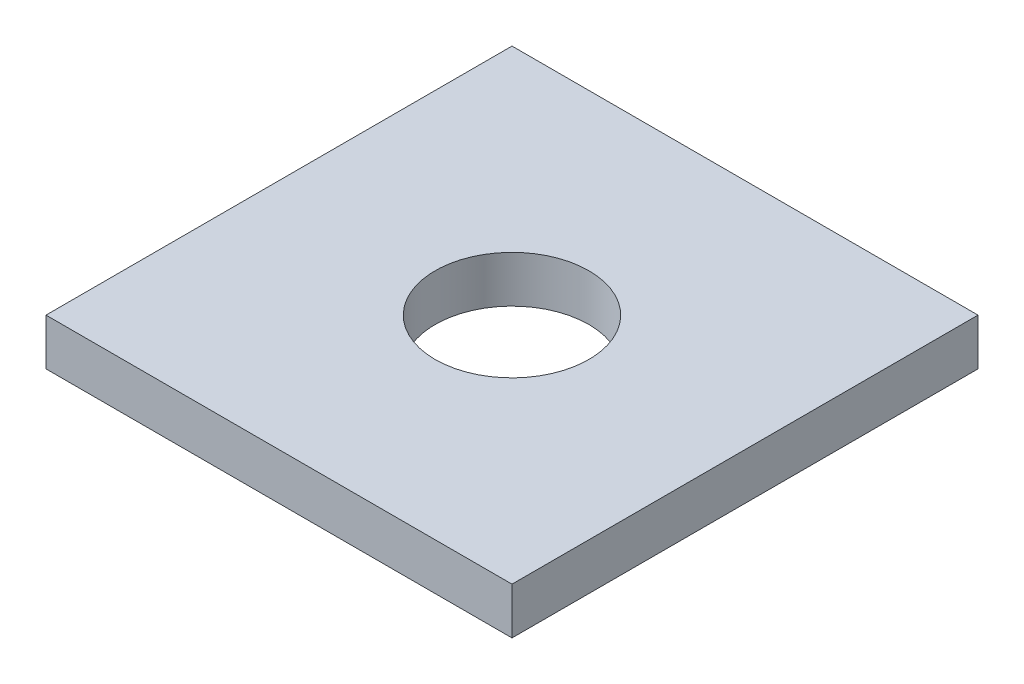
from build123d import *

# Parameters (mm, degrees)
SKETCH1_W           = 100
SKETCH1_H           = 100
SKETCH1_R           = 16.5
BOSS_EXTRUDE1_DEPTH = 10
SKETCH3_W           = 80
SKETCH3_H           = 80
SKETCH3_W_2         = 72
SKETCH3_H_2         = 72
BOSS_EXTRUDE2_DEPTH = 10


with BuildPart() as part:
    # Sketch1 → Boss-Extrude1 (new body)
    with BuildSketch(Plane(origin=(0, 0, 0), x_dir=(1, 0, 0), z_dir=(0, 1, 0))):
        Rectangle(SKETCH1_W, SKETCH1_H)
        with Locations(Location((0, 0, 0), (0, 0, 270))):
            Circle(SKETCH1_R, mode=Mode.SUBTRACT)
    extrude(amount=BOSS_EXTRUDE1_DEPTH)

    # Sketch3 → Boss-Extrude2 (add)
    with BuildSketch(Plane.XZ):
        Rectangle(SKETCH3_W, SKETCH3_H)
        Rectangle(SKETCH3_W_2, SKETCH3_H_2, mode=Mode.SUBTRACT)
    extrude(amount=BOSS_EXTRUDE2_DEPTH)


solid = part.part
